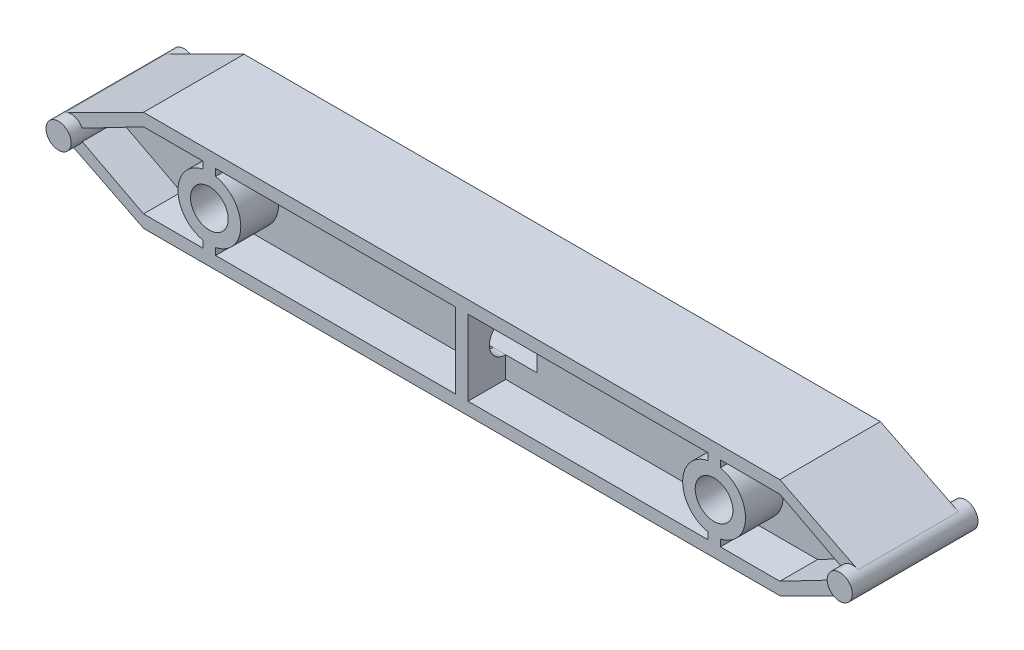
from build123d import *
from build123d.topology import SkipClean

# Parameters (mm, degrees)
SKETCH1_W           = 64.295936
SKETCH1_H           = 5.08
BOSS_EXTRUDE3_DEPTH = 10.16
CUT_EXTRUDE1_DEPTH  = 3.81
BOSS_EXTRUDE4_START = 1.27
SKETCH6_R           = 1.27
BOSS_EXTRUDE4_DEPTH = 1.27
CUT_EXTRUDE2_DEPTH  = 76.492672
SKETCH9_R           = 1.27
BOSS_EXTRUDE5_DEPTH = 1.27
CUT_EXTRUDE3_START  = -3.81
CUT_EXTRUDE3_DEPTH  = 3.81
SKETCH11_W          = 7.62
SKETCH11_H          = 1.651
CUT_EXTRUDE5_DEPTH  = 74.635096
BOSS_EXTRUDE6_START = 3.81
SKETCH12_R          = 1.905
SKETCH12_W          = 1.27
SKETCH12_H          = 7.62
BOSS_EXTRUDE6_DEPTH = 3.81
SKETCH13_R          = 1.651
CUT_EXTRUDE6_DEPTH  = 3.81
BOSS_EXTRUDE7_DEPTH = 3.81


with BuildPart() as part:
    # Sketch1 → Boss-Extrude3 (new body)
    with BuildSketch(Plane.XY):
        Polygon((-64.47318, 5.08), (-74.63318, 0), (-64.47318, 0), align=None)
        Polygon((-64.47318, 0), (-74.63318, 0), (-64.47318, -5.08), align=None)
        with Locations((-32.325212, 2.54)):
            Rectangle(SKETCH1_W, SKETCH1_H)
        with Locations((-32.325212, -2.54)):
            Rectangle(SKETCH1_W, SKETCH1_H)
        Polygon((9.982756, 0), (-0.177244, 0), (-0.177244, -5.08), align=None)
        Polygon((-0.177244, 5.08), (-0.177244, 0), (9.982756, 0), align=None)
    extrude(amount=BOSS_EXTRUDE3_DEPTH)

    # Sketch4 → Cut-Extrude1 (cut)
    with BuildSketch(Plane.XY.offset(10.16)):
        with BuildLine():
            Line((6.016404, 0.586342), (-0.177244, 3.81))
            Line((-0.177244, 3.81), (-64.47318, 3.81))
            Line((-64.47318, 3.81), (-70.666829, 0.586342))
            ThreePointArc((-70.666829, 0.586342), (-70.559759, 0.301818), (-70.523374, 0))
            ThreePointArc((-70.523374, 0), (-70.559759, -0.301818), (-70.666829, -0.586342))
            Line((-70.666829, -0.586342), (-64.47318, -3.81))
            Line((-64.47318, -3.81), (-0.177244, -3.81))
            Line((-0.177244, -3.81), (6.016404, -0.586342))
            ThreePointArc((6.016404, -0.586342), (5.872949, 0), (6.016404, 0.586342))
        make_face()
    extrude(amount=-CUT_EXTRUDE1_DEPTH, mode=Mode.SUBTRACT)

    # Sketch6 → Boss-Extrude4 (add)
    with SkipClean():  # the faces are left unmerged after this step: merging them gives an invalid solid
        with BuildSketch(Plane.XY.offset(10.16).offset(BOSS_EXTRUDE4_START)):
            with Locations((-71.793374, 0)):
                Circle(SKETCH6_R)
            with Locations((7.142949, 0)):
                Circle(SKETCH6_R)
        extrude(amount=-BOSS_EXTRUDE4_DEPTH)

    # Sketch7 → Cut-Extrude2 (cut, through all)
    with BuildSketch(Plane.XY.offset(10.16)):
        with BuildLine():
            Line((9.982756, 0), (7.710911, 1.135923))
            ThreePointArc((7.710911, 1.135923), (8.412949, 0), (7.710911, -1.135923))
            Line((7.710911, -1.135923), (9.982756, 0))
        make_face()
        with BuildLine():
            Line((-72.361335, 1.135923), (-74.63318, 0))
            Line((-74.63318, 0), (-72.361335, -1.135923))
            ThreePointArc((-72.361335, -1.135923), (-73.063374, 0), (-72.361335, 1.135923))
        make_face()
    extrude(amount=-CUT_EXTRUDE2_DEPTH, mode=Mode.SUBTRACT)

    # Sketch9 → Boss-Extrude5 (add)
    with BuildSketch(Plane(origin=(0, 0, 0), x_dir=(-1, 0, 0), z_dir=(0, 0, -1))):
        with Locations(Location((-7.142949, 0, 0), (0, 0, 180))):
            Circle(SKETCH9_R)
        with Locations(Location((71.793374, 0, 0), (0, 0, 180))):
            Circle(SKETCH9_R)
    extrude(amount=BOSS_EXTRUDE5_DEPTH)

    # Sketch10 → Cut-Extrude3 (cut)
    with SkipClean():  # the faces are left unmerged after this step: merging them gives an invalid solid
        with BuildSketch(Plane(origin=(0, 0, 0), x_dir=(-1, 0, 0), z_dir=(0, 0, -1)).offset(CUT_EXTRUDE3_START)):
            with BuildLine():
                Line((64.47318, 3.81), (0.177244, 3.81))
                Line((0.177244, 3.81), (-6.290478, 0.941378))
                ThreePointArc((-6.290478, 0.941378), (-5.872949, 0), (-6.290478, -0.941378))
                Line((-6.290478, -0.941378), (0.177244, -3.81))
                Line((0.177244, -3.81), (64.47318, -3.81))
                Line((64.47318, -3.81), (70.666829, -0.586342))
                ThreePointArc((70.666829, -0.586342), (70.523374, 0), (70.666829, 0.586342))
                Line((70.666829, 0.586342), (64.47318, 3.81))
            make_face()
        extrude(amount=CUT_EXTRUDE3_DEPTH, mode=Mode.SUBTRACT)

    # Sketch11 → Cut-Extrude5 (cut, through all)
    with SkipClean():  # the faces are left unmerged after this step: merging them gives an invalid solid
        with BuildSketch(Plane.XY.offset(6.35)):
            with BuildLine():
                ThreePointArc((-55.918374, 0), (-57.823374, 1.905), (-59.728374, 0))
                Line((-59.728374, 0), (-57.823374, 0))
                Line((-57.823374, 0), (-55.918374, 0))
            make_face()
            with BuildLine():
                Line((-57.823374, 0), (-59.728374, 0))
                ThreePointArc((-59.728374, 0), (-57.823374, -1.905), (-55.918374, 0))
                Line((-55.918374, 0), (-57.823374, 0))
            make_face()
            with BuildLine():
                ThreePointArc((-55.918374, 0), (-57.823374, 1.905), (-59.728374, 0))
                Line((-59.728374, 0), (-57.823374, 0))
                Line((-57.823374, 0), (-55.918374, 0))
            make_face()
            with BuildLine():
                Line((-57.823374, 0), (-59.728374, 0))
                ThreePointArc((-59.728374, 0), (-57.823374, -1.905), (-55.918374, 0))
                Line((-55.918374, 0), (-57.823374, 0))
            make_face()
            with Locations((-32.325212, 0.8255)):
                Rectangle(SKETCH11_W, SKETCH11_H)
            with Locations((-32.325212, -0.8255)):
                Rectangle(SKETCH11_W, SKETCH11_H)
            with BuildLine():
                ThreePointArc((-4.922051, 0), (-6.827051, 1.905), (-8.732051, 0))
                Line((-8.732051, 0), (-6.827051, 0))
                Line((-6.827051, 0), (-4.922051, 0))
            make_face()
            with BuildLine():
                Line((-6.827051, 0), (-8.732051, 0))
                ThreePointArc((-8.732051, 0), (-6.827051, -1.905), (-4.922051, 0))
                Line((-4.922051, 0), (-6.827051, 0))
            make_face()
        extrude(amount=-CUT_EXTRUDE5_DEPTH, mode=Mode.SUBTRACT)

    # Sketch12 → Boss-Extrude6 (add)
    # profile 1 of 3: a face of its own
    with SkipClean():  # the faces are left unmerged after this step: merging them gives an invalid solid
        with BuildSketch(Plane.XY.offset(6.35).offset(BOSS_EXTRUDE6_START)):
            with BuildLine():
                Line((-57.188374, 3.81), (-58.458374, 3.81))
                Line((-58.458374, 3.81), (-58.458374, 3.110852))
                ThreePointArc((-58.458374, 3.110852), (-60.998374, 0), (-58.458374, -3.110852))
                Line((-58.458374, -3.110852), (-58.458374, -3.81))
                Line((-58.458374, -3.81), (-57.188374, -3.81))
                Line((-57.188374, -3.81), (-57.188374, -3.110852))
                ThreePointArc((-57.188374, -3.110852), (-54.648374, 0), (-57.188374, 3.110852))
                Line((-57.188374, 3.110852), (-57.188374, 3.81))
            make_face()
            with Locations((-57.823374, 0)):
                Circle(SKETCH12_R, mode=Mode.SUBTRACT)
        # profile 2 of 3: a face of its own
        with BuildSketch(Plane.XY.offset(6.35).offset(BOSS_EXTRUDE6_START)):
            with Locations((-32.325212, 0)):
                Rectangle(SKETCH12_W, SKETCH12_H)
        # profile 3 of 3: a face of its own
        with BuildSketch(Plane.XY.offset(6.35).offset(BOSS_EXTRUDE6_START)):
            with BuildLine():
                Line((-6.192051, 3.81), (-7.462051, 3.81))
                Line((-7.462051, 3.81), (-7.462051, 3.110852))
                ThreePointArc((-7.462051, 3.110852), (-10.002051, 0), (-7.462051, -3.110852))
                Line((-7.462051, -3.110852), (-7.462051, -3.81))
                Line((-7.462051, -3.81), (-6.192051, -3.81))
                Line((-6.192051, -3.81), (-6.192051, -3.110852))
                ThreePointArc((-6.192051, -3.110852), (-3.652051, 0), (-6.192051, 3.110852))
                Line((-6.192051, 3.110852), (-6.192051, 3.81))
            make_face()
            with Locations((-6.827051, 0)):
                Circle(SKETCH12_R, mode=Mode.SUBTRACT)
        extrude(amount=-BOSS_EXTRUDE6_DEPTH)

    # Sketch13 → Cut-Extrude6 (cut)
    with SkipClean():  # the faces are left unmerged after this step: merging them gives an invalid solid
        with BuildSketch(Plane.ZY.offset(32.960212)):
            with Locations((6.35, 0)):
                Circle(SKETCH13_R)
        extrude(amount=-CUT_EXTRUDE6_DEPTH, mode=Mode.SUBTRACT)

    # Sketch14 → Boss-Extrude7 (add)
    with SkipClean():  # the faces are left unmerged after this step: merging them gives an invalid solid
        with BuildSketch(Plane(origin=(0, 0, 3.81), x_dir=(-1, 0, 0), z_dir=(0, 0, -1))):
            with BuildLine():
                Line((58.458374, 3.81), (57.188374, 3.81))
                Line((57.188374, 3.81), (57.188374, 3.110852))
                ThreePointArc((57.188374, 3.110852), (57.823374, 3.175), (58.458374, 3.110852))
                Line((58.458374, 3.110852), (58.458374, 3.81))
            make_face()
            with BuildLine():
                ThreePointArc((58.458374, 3.110852), (57.823374, 3.175), (57.188374, 3.110852))
                Line((57.188374, 3.110852), (57.188374, 1.796051))
                ThreePointArc((57.188374, 1.796051), (57.823374, 1.905), (58.458374, 1.796051))
                Line((58.458374, 1.796051), (58.458374, 3.110852))
            make_face()
            with BuildLine():
                Line((57.188374, -1.796051), (57.188374, -3.110852))
                ThreePointArc((57.188374, -3.110852), (57.823374, -3.175), (58.458374, -3.110852))
                Line((58.458374, -3.110852), (58.458374, -1.796051))
                ThreePointArc((58.458374, -1.796051), (57.823374, -1.905), (57.188374, -1.796051))
            make_face()
            with BuildLine():
                Line((57.188374, 1.796051), (57.188374, 3.110852))
                ThreePointArc((57.188374, 3.110852), (54.648374, 0), (57.188374, -3.110852))
                Line((57.188374, -3.110852), (57.188374, -1.796051))
                ThreePointArc((57.188374, -1.796051), (55.918374, 0), (57.188374, 1.796051))
            make_face()
            with BuildLine():
                ThreePointArc((60.998374, 0), (60.282718, 2.008046), (58.458374, 3.110852))
                Line((58.458374, 3.110852), (58.458374, 1.796051))
                ThreePointArc((58.458374, 1.796051), (59.3788, 1.099852), (59.728374, 0))
                ThreePointArc((59.728374, 0), (59.3788, -1.099852), (58.458374, -1.796051))
                Line((58.458374, -1.796051), (58.458374, -3.110852))
                ThreePointArc((58.458374, -3.110852), (60.282718, -2.008046), (60.998374, 0))
            make_face()
            with BuildLine():
                ThreePointArc((58.458374, 3.110852), (57.823374, 3.175), (57.188374, 3.110852))
                Line((57.188374, 3.110852), (57.188374, 1.796051))
                ThreePointArc((57.188374, 1.796051), (57.823374, 1.905), (58.458374, 1.796051))
                Line((58.458374, 1.796051), (58.458374, 3.110852))
            make_face()
            with BuildLine():
                Line((57.188374, -1.796051), (57.188374, -3.110852))
                ThreePointArc((57.188374, -3.110852), (57.823374, -3.175), (58.458374, -3.110852))
                Line((58.458374, -3.110852), (58.458374, -1.796051))
                ThreePointArc((58.458374, -1.796051), (57.823374, -1.905), (57.188374, -1.796051))
            make_face()
            with BuildLine():
                ThreePointArc((58.458374, -3.110852), (57.823374, -3.175), (57.188374, -3.110852))
                Line((57.188374, -3.110852), (57.188374, -3.81))
                Line((57.188374, -3.81), (58.458374, -3.81))
                Line((58.458374, -3.81), (58.458374, -3.110852))
            make_face()
            with BuildLine():
                Line((7.462051, 3.81), (6.192051, 3.81))
                Line((6.192051, 3.81), (6.192051, 3.110852))
                ThreePointArc((6.192051, 3.110852), (6.827051, 3.175), (7.462051, 3.110852))
                Line((7.462051, 3.110852), (7.462051, 3.81))
            make_face()
            with BuildLine():
                ThreePointArc((7.462051, 3.110852), (6.827051, 3.175), (6.192051, 3.110852))
                Line((6.192051, 3.110852), (6.192051, 1.796051))
                ThreePointArc((6.192051, 1.796051), (6.827051, 1.905), (7.462051, 1.796051))
                Line((7.462051, 1.796051), (7.462051, 3.110852))
            make_face()
            with BuildLine():
                Line((6.192051, -1.796051), (6.192051, -3.110852))
                ThreePointArc((6.192051, -3.110852), (6.827051, -3.175), (7.462051, -3.110852))
                Line((7.462051, -3.110852), (7.462051, -1.796051))
                ThreePointArc((7.462051, -1.796051), (6.827051, -1.905), (6.192051, -1.796051))
            make_face()
            with BuildLine():
                Line((6.192051, 1.796051), (6.192051, 3.110852))
                ThreePointArc((6.192051, 3.110852), (3.652051, 0), (6.192051, -3.110852))
                Line((6.192051, -3.110852), (6.192051, -1.796051))
                ThreePointArc((6.192051, -1.796051), (4.922051, 0), (6.192051, 1.796051))
            make_face()
            with BuildLine():
                ThreePointArc((7.462051, 3.110852), (6.827051, 3.175), (6.192051, 3.110852))
                Line((6.192051, 3.110852), (6.192051, 1.796051))
                ThreePointArc((6.192051, 1.796051), (6.827051, 1.905), (7.462051, 1.796051))
                Line((7.462051, 1.796051), (7.462051, 3.110852))
            make_face()
            with BuildLine():
                Line((6.192051, -1.796051), (6.192051, -3.110852))
                ThreePointArc((6.192051, -3.110852), (6.827051, -3.175), (7.462051, -3.110852))
                Line((7.462051, -3.110852), (7.462051, -1.796051))
                ThreePointArc((7.462051, -1.796051), (6.827051, -1.905), (6.192051, -1.796051))
            make_face()
            with BuildLine():
                ThreePointArc((7.462051, -3.110852), (6.827051, -3.175), (6.192051, -3.110852))
                Line((6.192051, -3.110852), (6.192051, -3.81))
                Line((6.192051, -3.81), (7.462051, -3.81))
                Line((7.462051, -3.81), (7.462051, -3.110852))
            make_face()
            with BuildLine():
                ThreePointArc((10.002051, 0), (9.286395, 2.008046), (7.462051, 3.110852))
                Line((7.462051, 3.110852), (7.462051, 1.796051))
                ThreePointArc((7.462051, 1.796051), (8.382477, 1.099852), (8.732051, 0))
                ThreePointArc((8.732051, 0), (8.382477, -1.099852), (7.462051, -1.796051))
                Line((7.462051, -1.796051), (7.462051, -3.110852))
                ThreePointArc((7.462051, -3.110852), (9.286395, -2.008046), (10.002051, 0))
            make_face()
        extrude(amount=BOSS_EXTRUDE7_DEPTH)


solid = part.part
